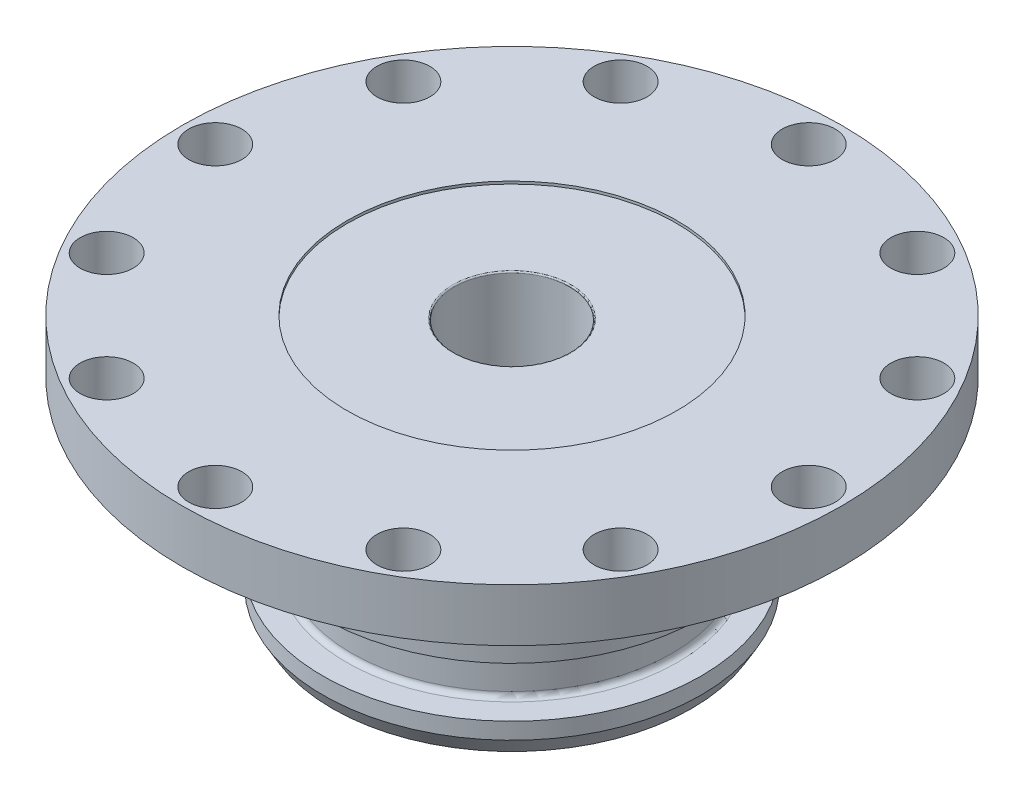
ISO-10303-21;
HEADER;
FILE_DESCRIPTION(('STEP AP214'),'2;1');
FILE_NAME('part.step','',(''),(''),'','','');
FILE_SCHEMA(('AUTOMOTIVE_DESIGN { 1 0 10303 214 1 1 1 1 }'));
ENDSEC;
DATA;
#1=APPLICATION_CONTEXT('core data for automotive mechanical design processes');
#2=APPLICATION_PROTOCOL_DEFINITION('international standard','automotive_design',2000,#1);
#3=PRODUCT_CONTEXT('',#1,'mechanical');
#4=PRODUCT('Part','Part','',(#3));
#5=PRODUCT_RELATED_PRODUCT_CATEGORY('part','',(#4));
#6=PRODUCT_DEFINITION_FORMATION('','',#4);
#7=PRODUCT_DEFINITION_CONTEXT('part definition',#1,'design');
#8=PRODUCT_DEFINITION('design','',#6,#7);
#9=PRODUCT_DEFINITION_SHAPE('','',#8);
#10=(LENGTH_UNIT() NAMED_UNIT(*) SI_UNIT(.MILLI.,.METRE.));
#11=(NAMED_UNIT(*) PLANE_ANGLE_UNIT() SI_UNIT($,.RADIAN.));
#12=(NAMED_UNIT(*) SI_UNIT($,.STERADIAN.) SOLID_ANGLE_UNIT());
#13=UNCERTAINTY_MEASURE_WITH_UNIT(LENGTH_MEASURE(1.E-05),#10,'distance_accuracy_value','');
#14=(GEOMETRIC_REPRESENTATION_CONTEXT(3) GLOBAL_UNCERTAINTY_ASSIGNED_CONTEXT((#13)) GLOBAL_UNIT_ASSIGNED_CONTEXT((#10,
#11,#12)) REPRESENTATION_CONTEXT('',''));
#15=CARTESIAN_POINT('',(0.,0.,0.));
#16=DIRECTION('',(0.,0.,1.));
#17=DIRECTION('',(1.,0.,0.));
#18=AXIS2_PLACEMENT_3D('',#15,#16,#17);
#19=CARTESIAN_POINT('',(31.75,24.13,0.));
#20=DIRECTION('',(0.,-1.,0.));
#21=DIRECTION('',(1.,0.,0.));
#22=AXIS2_PLACEMENT_3D('',#19,#20,#21);
#23=PLANE('',#22);
#24=CARTESIAN_POINT('',(0.,24.13,0.));
#25=DIRECTION('',(0.,1.,0.));
#26=DIRECTION('',(-1.,0.,0.));
#27=AXIS2_PLACEMENT_3D('',#24,#25,#26);
#28=CIRCLE('',#27,15.875);
#29=CARTESIAN_POINT('',(-15.875,24.13,0.));
#30=VERTEX_POINT('',#29);
#31=EDGE_CURVE('E173',#30,#30,#28,.T.);
#32=ORIENTED_EDGE('',*,*,#31,.F.);
#33=EDGE_LOOP('',(#32));
#34=FACE_BOUND('',#33,.T.);
#35=CARTESIAN_POINT('',(0.,24.13,-28.575));
#36=DIRECTION('',(0.,1.,0.));
#37=DIRECTION('',(0.,0.,1.));
#38=AXIS2_PLACEMENT_3D('',#35,#36,#37);
#39=CIRCLE('',#38,2.5527);
#40=CARTESIAN_POINT('',(0.,24.13,-26.0223));
#41=VERTEX_POINT('',#40);
#42=EDGE_CURVE('E81',#41,#41,#39,.T.);
#43=ORIENTED_EDGE('',*,*,#42,.F.);
#44=EDGE_LOOP('',(#43));
#45=FACE_BOUND('',#44,.T.);
#46=CARTESIAN_POINT('',(14.2875,24.13,-24.7466759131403));
#47=DIRECTION('',(0.,1.,0.));
#48=DIRECTION('',(0.,0.,1.));
#49=AXIS2_PLACEMENT_3D('',#46,#47,#48);
#50=CIRCLE('',#49,2.5527);
#51=CARTESIAN_POINT('',(14.2875,24.13,-22.1939759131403));
#52=VERTEX_POINT('',#51);
#53=EDGE_CURVE('E80',#52,#52,#50,.T.);
#54=ORIENTED_EDGE('',*,*,#53,.F.);
#55=EDGE_LOOP('',(#54));
#56=FACE_BOUND('',#55,.T.);
#57=CARTESIAN_POINT('',(24.7466759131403,24.13,-14.2875));
#58=DIRECTION('',(0.,1.,0.));
#59=DIRECTION('',(0.,0.,1.));
#60=AXIS2_PLACEMENT_3D('',#57,#58,#59);
#61=CIRCLE('',#60,2.5527);
#62=CARTESIAN_POINT('',(24.7466759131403,24.13,-11.7348));
#63=VERTEX_POINT('',#62);
#64=EDGE_CURVE('E85',#63,#63,#61,.T.);
#65=ORIENTED_EDGE('',*,*,#64,.F.);
#66=EDGE_LOOP('',(#65));
#67=FACE_BOUND('',#66,.T.);
#68=CARTESIAN_POINT('',(28.575,24.13,0.));
#69=DIRECTION('',(0.,1.,0.));
#70=DIRECTION('',(0.,0.,1.));
#71=AXIS2_PLACEMENT_3D('',#68,#69,#70);
#72=CIRCLE('',#71,2.5527);
#73=CARTESIAN_POINT('',(28.575,24.13,2.5527));
#74=VERTEX_POINT('',#73);
#75=EDGE_CURVE('E89',#74,#74,#72,.T.);
#76=ORIENTED_EDGE('',*,*,#75,.F.);
#77=EDGE_LOOP('',(#76));
#78=FACE_BOUND('',#77,.T.);
#79=CARTESIAN_POINT('',(24.7466759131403,24.13,14.2875));
#80=DIRECTION('',(0.,1.,0.));
#81=DIRECTION('',(0.,0.,1.));
#82=AXIS2_PLACEMENT_3D('',#79,#80,#81);
#83=CIRCLE('',#82,2.5527);
#84=CARTESIAN_POINT('',(24.7466759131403,24.13,16.8402));
#85=VERTEX_POINT('',#84);
#86=EDGE_CURVE('E93',#85,#85,#83,.T.);
#87=ORIENTED_EDGE('',*,*,#86,.F.);
#88=EDGE_LOOP('',(#87));
#89=FACE_BOUND('',#88,.T.);
#90=CARTESIAN_POINT('',(14.2875,24.13,24.7466759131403));
#91=DIRECTION('',(0.,1.,0.));
#92=DIRECTION('',(0.,0.,1.));
#93=AXIS2_PLACEMENT_3D('',#90,#91,#92);
#94=CIRCLE('',#93,2.5527);
#95=CARTESIAN_POINT('',(14.2875,24.13,27.2993759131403));
#96=VERTEX_POINT('',#95);
#97=EDGE_CURVE('E97',#96,#96,#94,.T.);
#98=ORIENTED_EDGE('',*,*,#97,.F.);
#99=EDGE_LOOP('',(#98));
#100=FACE_BOUND('',#99,.T.);
#101=CARTESIAN_POINT('',(0.,24.13,28.575));
#102=DIRECTION('',(0.,1.,0.));
#103=DIRECTION('',(0.,0.,1.));
#104=AXIS2_PLACEMENT_3D('',#101,#102,#103);
#105=CIRCLE('',#104,2.5527);
#106=CARTESIAN_POINT('',(0.,24.13,31.1277));
#107=VERTEX_POINT('',#106);
#108=EDGE_CURVE('E101',#107,#107,#105,.T.);
#109=ORIENTED_EDGE('',*,*,#108,.F.);
#110=EDGE_LOOP('',(#109));
#111=FACE_BOUND('',#110,.T.);
#112=CARTESIAN_POINT('',(-14.2875,24.13,24.7466759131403));
#113=DIRECTION('',(0.,1.,0.));
#114=DIRECTION('',(0.,0.,1.));
#115=AXIS2_PLACEMENT_3D('',#112,#113,#114);
#116=CIRCLE('',#115,2.5527);
#117=CARTESIAN_POINT('',(-14.2875,24.13,27.2993759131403));
#118=VERTEX_POINT('',#117);
#119=EDGE_CURVE('E105',#118,#118,#116,.T.);
#120=ORIENTED_EDGE('',*,*,#119,.F.);
#121=EDGE_LOOP('',(#120));
#122=FACE_BOUND('',#121,.T.);
#123=CARTESIAN_POINT('',(-24.7466759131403,24.13,14.2875));
#124=DIRECTION('',(0.,1.,0.));
#125=DIRECTION('',(0.,0.,1.));
#126=AXIS2_PLACEMENT_3D('',#123,#124,#125);
#127=CIRCLE('',#126,2.5527);
#128=CARTESIAN_POINT('',(-24.7466759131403,24.13,16.8402));
#129=VERTEX_POINT('',#128);
#130=EDGE_CURVE('E109',#129,#129,#127,.T.);
#131=ORIENTED_EDGE('',*,*,#130,.F.);
#132=EDGE_LOOP('',(#131));
#133=FACE_BOUND('',#132,.T.);
#134=CARTESIAN_POINT('',(-28.575,24.13,0.));
#135=DIRECTION('',(0.,1.,0.));
#136=DIRECTION('',(0.,0.,1.));
#137=AXIS2_PLACEMENT_3D('',#134,#135,#136);
#138=CIRCLE('',#137,2.5527);
#139=CARTESIAN_POINT('',(-28.575,24.13,2.5527));
#140=VERTEX_POINT('',#139);
#141=EDGE_CURVE('E113',#140,#140,#138,.T.);
#142=ORIENTED_EDGE('',*,*,#141,.F.);
#143=EDGE_LOOP('',(#142));
#144=FACE_BOUND('',#143,.T.);
#145=CARTESIAN_POINT('',(-24.7466759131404,24.13,-14.2875));
#146=DIRECTION('',(0.,1.,0.));
#147=DIRECTION('',(0.,0.,1.));
#148=AXIS2_PLACEMENT_3D('',#145,#146,#147);
#149=CIRCLE('',#148,2.5527);
#150=CARTESIAN_POINT('',(-24.7466759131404,24.13,-11.7348));
#151=VERTEX_POINT('',#150);
#152=EDGE_CURVE('E117',#151,#151,#149,.T.);
#153=ORIENTED_EDGE('',*,*,#152,.F.);
#154=EDGE_LOOP('',(#153));
#155=FACE_BOUND('',#154,.T.);
#156=CARTESIAN_POINT('',(-14.2875,24.13,-24.7466759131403));
#157=DIRECTION('',(0.,1.,0.));
#158=DIRECTION('',(0.,0.,1.));
#159=AXIS2_PLACEMENT_3D('',#156,#157,#158);
#160=CIRCLE('',#159,2.5527);
#161=CARTESIAN_POINT('',(-14.2875,24.13,-22.1939759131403));
#162=VERTEX_POINT('',#161);
#163=EDGE_CURVE('E121',#162,#162,#160,.T.);
#164=ORIENTED_EDGE('',*,*,#163,.F.);
#165=EDGE_LOOP('',(#164));
#166=FACE_BOUND('',#165,.T.);
#167=CARTESIAN_POINT('',(0.,24.13,0.));
#168=DIRECTION('',(0.,1.,0.));
#169=DIRECTION('',(-1.,0.,0.));
#170=AXIS2_PLACEMENT_3D('',#167,#168,#169);
#171=CIRCLE('',#170,31.75);
#172=CARTESIAN_POINT('',(-31.75,24.13,0.));
#173=VERTEX_POINT('',#172);
#174=EDGE_CURVE('E76',#173,#173,#171,.T.);
#175=ORIENTED_EDGE('',*,*,#174,.T.);
#176=EDGE_LOOP('',(#175));
#177=FACE_BOUND('',#176,.T.);
#178=ADVANCED_FACE('F32',(#34,#45,#56,#67,#78,#89,#100,#111,#122,#133,#144,#155,#166,#177),#23,.F.);
#179=CARTESIAN_POINT('',(0.,0.,0.));
#180=DIRECTION('',(0.,1.,0.));
#181=DIRECTION('',(-1.,0.,0.));
#182=AXIS2_PLACEMENT_3D('',#179,#180,#181);
#183=CYLINDRICAL_SURFACE('',#182,31.75);
#184=ORIENTED_EDGE('',*,*,#174,.F.);
#185=EDGE_LOOP('',(#184));
#186=FACE_BOUND('',#185,.T.);
#187=CARTESIAN_POINT('',(0.,19.05,0.));
#188=DIRECTION('',(0.,1.,0.));
#189=DIRECTION('',(-1.,0.,0.));
#190=AXIS2_PLACEMENT_3D('',#187,#188,#189);
#191=CIRCLE('',#190,31.75);
#192=CARTESIAN_POINT('',(-31.75,19.05,0.));
#193=VERTEX_POINT('',#192);
#194=EDGE_CURVE('E128',#193,#193,#191,.T.);
#195=ORIENTED_EDGE('',*,*,#194,.T.);
#196=EDGE_LOOP('',(#195));
#197=FACE_BOUND('',#196,.T.);
#198=ADVANCED_FACE('F198',(#186,#197),#183,.T.);
#199=CARTESIAN_POINT('',(19.00555,19.05,0.));
#200=DIRECTION('',(0.,1.,0.));
#201=DIRECTION('',(-1.,0.,0.));
#202=AXIS2_PLACEMENT_3D('',#199,#200,#201);
#203=PLANE('',#202);
#204=CARTESIAN_POINT('',(0.,19.05,-28.575));
#205=DIRECTION('',(0.,1.,0.));
#206=DIRECTION('',(-1.,0.,0.));
#207=AXIS2_PLACEMENT_3D('',#204,#205,#206);
#208=CIRCLE('',#207,2.5527);
#209=CARTESIAN_POINT('',(-2.5527,19.05,-28.575));
#210=VERTEX_POINT('',#209);
#211=EDGE_CURVE('E77',#210,#210,#208,.T.);
#212=ORIENTED_EDGE('',*,*,#211,.T.);
#213=EDGE_LOOP('',(#212));
#214=FACE_BOUND('',#213,.T.);
#215=CARTESIAN_POINT('',(14.2875,19.05,-24.7466759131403));
#216=DIRECTION('',(0.,1.,0.));
#217=DIRECTION('',(-1.,0.,0.));
#218=AXIS2_PLACEMENT_3D('',#215,#216,#217);
#219=CIRCLE('',#218,2.5527);
#220=CARTESIAN_POINT('',(11.7348,19.05,-24.7466759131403));
#221=VERTEX_POINT('',#220);
#222=EDGE_CURVE('E82',#221,#221,#219,.T.);
#223=ORIENTED_EDGE('',*,*,#222,.T.);
#224=EDGE_LOOP('',(#223));
#225=FACE_BOUND('',#224,.T.);
#226=CARTESIAN_POINT('',(24.7466759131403,19.05,-14.2875));
#227=DIRECTION('',(0.,1.,0.));
#228=DIRECTION('',(-1.,0.,0.));
#229=AXIS2_PLACEMENT_3D('',#226,#227,#228);
#230=CIRCLE('',#229,2.5527);
#231=CARTESIAN_POINT('',(22.1939759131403,19.05,-14.2875));
#232=VERTEX_POINT('',#231);
#233=EDGE_CURVE('E86',#232,#232,#230,.T.);
#234=ORIENTED_EDGE('',*,*,#233,.T.);
#235=EDGE_LOOP('',(#234));
#236=FACE_BOUND('',#235,.T.);
#237=CARTESIAN_POINT('',(28.575,19.05,0.));
#238=DIRECTION('',(0.,1.,0.));
#239=DIRECTION('',(-1.,0.,0.));
#240=AXIS2_PLACEMENT_3D('',#237,#238,#239);
#241=CIRCLE('',#240,2.5527);
#242=CARTESIAN_POINT('',(26.0223,19.05,0.));
#243=VERTEX_POINT('',#242);
#244=EDGE_CURVE('E90',#243,#243,#241,.T.);
#245=ORIENTED_EDGE('',*,*,#244,.T.);
#246=EDGE_LOOP('',(#245));
#247=FACE_BOUND('',#246,.T.);
#248=CARTESIAN_POINT('',(24.7466759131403,19.05,14.2875));
#249=DIRECTION('',(0.,1.,0.));
#250=DIRECTION('',(-1.,0.,0.));
#251=AXIS2_PLACEMENT_3D('',#248,#249,#250);
#252=CIRCLE('',#251,2.5527);
#253=CARTESIAN_POINT('',(22.1939759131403,19.05,14.2875));
#254=VERTEX_POINT('',#253);
#255=EDGE_CURVE('E94',#254,#254,#252,.T.);
#256=ORIENTED_EDGE('',*,*,#255,.T.);
#257=EDGE_LOOP('',(#256));
#258=FACE_BOUND('',#257,.T.);
#259=CARTESIAN_POINT('',(14.2875,19.05,24.7466759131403));
#260=DIRECTION('',(0.,1.,0.));
#261=DIRECTION('',(-1.,0.,0.));
#262=AXIS2_PLACEMENT_3D('',#259,#260,#261);
#263=CIRCLE('',#262,2.5527);
#264=CARTESIAN_POINT('',(11.7348,19.05,24.7466759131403));
#265=VERTEX_POINT('',#264);
#266=EDGE_CURVE('E98',#265,#265,#263,.T.);
#267=ORIENTED_EDGE('',*,*,#266,.T.);
#268=EDGE_LOOP('',(#267));
#269=FACE_BOUND('',#268,.T.);
#270=CARTESIAN_POINT('',(0.,19.05,28.575));
#271=DIRECTION('',(0.,1.,0.));
#272=DIRECTION('',(-1.,0.,0.));
#273=AXIS2_PLACEMENT_3D('',#270,#271,#272);
#274=CIRCLE('',#273,2.5527);
#275=CARTESIAN_POINT('',(-2.55269999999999,19.05,28.575));
#276=VERTEX_POINT('',#275);
#277=EDGE_CURVE('E102',#276,#276,#274,.T.);
#278=ORIENTED_EDGE('',*,*,#277,.T.);
#279=EDGE_LOOP('',(#278));
#280=FACE_BOUND('',#279,.T.);
#281=CARTESIAN_POINT('',(-14.2875,19.05,24.7466759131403));
#282=DIRECTION('',(0.,1.,0.));
#283=DIRECTION('',(-1.,0.,0.));
#284=AXIS2_PLACEMENT_3D('',#281,#282,#283);
#285=CIRCLE('',#284,2.5527);
#286=CARTESIAN_POINT('',(-16.8402,19.05,24.7466759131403));
#287=VERTEX_POINT('',#286);
#288=EDGE_CURVE('E106',#287,#287,#285,.T.);
#289=ORIENTED_EDGE('',*,*,#288,.T.);
#290=EDGE_LOOP('',(#289));
#291=FACE_BOUND('',#290,.T.);
#292=CARTESIAN_POINT('',(-24.7466759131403,19.05,14.2875));
#293=DIRECTION('',(0.,1.,0.));
#294=DIRECTION('',(-1.,0.,0.));
#295=AXIS2_PLACEMENT_3D('',#292,#293,#294);
#296=CIRCLE('',#295,2.5527);
#297=CARTESIAN_POINT('',(-27.2993759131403,19.05,14.2875));
#298=VERTEX_POINT('',#297);
#299=EDGE_CURVE('E110',#298,#298,#296,.T.);
#300=ORIENTED_EDGE('',*,*,#299,.T.);
#301=EDGE_LOOP('',(#300));
#302=FACE_BOUND('',#301,.T.);
#303=CARTESIAN_POINT('',(-28.575,19.05,0.));
#304=DIRECTION('',(0.,1.,0.));
#305=DIRECTION('',(-1.,0.,0.));
#306=AXIS2_PLACEMENT_3D('',#303,#304,#305);
#307=CIRCLE('',#306,2.5527);
#308=CARTESIAN_POINT('',(-31.1277,19.05,0.));
#309=VERTEX_POINT('',#308);
#310=EDGE_CURVE('E114',#309,#309,#307,.T.);
#311=ORIENTED_EDGE('',*,*,#310,.T.);
#312=EDGE_LOOP('',(#311));
#313=FACE_BOUND('',#312,.T.);
#314=CARTESIAN_POINT('',(-24.7466759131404,19.05,-14.2875));
#315=DIRECTION('',(0.,1.,0.));
#316=DIRECTION('',(-1.,0.,0.));
#317=AXIS2_PLACEMENT_3D('',#314,#315,#316);
#318=CIRCLE('',#317,2.5527);
#319=CARTESIAN_POINT('',(-27.2993759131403,19.05,-14.2875));
#320=VERTEX_POINT('',#319);
#321=EDGE_CURVE('E118',#320,#320,#318,.T.);
#322=ORIENTED_EDGE('',*,*,#321,.T.);
#323=EDGE_LOOP('',(#322));
#324=FACE_BOUND('',#323,.T.);
#325=CARTESIAN_POINT('',(-14.2875,19.05,-24.7466759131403));
#326=DIRECTION('',(0.,1.,0.));
#327=DIRECTION('',(-1.,0.,0.));
#328=AXIS2_PLACEMENT_3D('',#325,#326,#327);
#329=CIRCLE('',#328,2.5527);
#330=CARTESIAN_POINT('',(-16.8402,19.05,-24.7466759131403));
#331=VERTEX_POINT('',#330);
#332=EDGE_CURVE('E122',#331,#331,#329,.T.);
#333=ORIENTED_EDGE('',*,*,#332,.T.);
#334=EDGE_LOOP('',(#333));
#335=FACE_BOUND('',#334,.T.);
#336=ORIENTED_EDGE('',*,*,#194,.F.);
#337=EDGE_LOOP('',(#336));
#338=FACE_BOUND('',#337,.T.);
#339=CARTESIAN_POINT('',(0.,19.05,0.));
#340=DIRECTION('',(0.,1.,0.));
#341=DIRECTION('',(-1.,0.,0.));
#342=AXIS2_PLACEMENT_3D('',#339,#340,#341);
#343=CIRCLE('',#342,19.00555);
#344=CARTESIAN_POINT('',(-19.00555,19.05,0.));
#345=VERTEX_POINT('',#344);
#346=EDGE_CURVE('E131',#345,#345,#343,.T.);
#347=ORIENTED_EDGE('',*,*,#346,.T.);
#348=EDGE_LOOP('',(#347));
#349=FACE_BOUND('',#348,.T.);
#350=ADVANCED_FACE('F204',(#214,#225,#236,#247,#258,#269,#280,#291,#302,#313,#324,#335,#338,
#349),#203,.F.);
#351=CARTESIAN_POINT('',(0.,18.25625,0.));
#352=DIRECTION('',(0.,1.,0.));
#353=DIRECTION('',(-1.,0.,0.));
#354=AXIS2_PLACEMENT_3D('',#351,#352,#353);
#355=TOROIDAL_SURFACE('',#354,19.00555,0.793749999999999);
#356=ORIENTED_EDGE('',*,*,#346,.F.);
#357=EDGE_LOOP('',(#356));
#358=FACE_BOUND('',#357,.T.);
#359=CARTESIAN_POINT('',(0.,18.25625,0.));
#360=DIRECTION('',(0.,1.,0.));
#361=DIRECTION('',(-1.,0.,0.));
#362=AXIS2_PLACEMENT_3D('',#359,#360,#361);
#363=CIRCLE('',#362,18.2118);
#364=CARTESIAN_POINT('',(-18.2118,18.25625,0.));
#365=VERTEX_POINT('',#364);
#366=EDGE_CURVE('E134',#365,#365,#363,.T.);
#367=ORIENTED_EDGE('',*,*,#366,.T.);
#368=EDGE_LOOP('',(#367));
#369=FACE_BOUND('',#368,.T.);
#370=ADVANCED_FACE('F241',(#358,#369),#355,.F.);
#371=CARTESIAN_POINT('',(0.,0.,0.));
#372=DIRECTION('',(0.,1.,0.));
#373=DIRECTION('',(-1.,0.,0.));
#374=AXIS2_PLACEMENT_3D('',#371,#372,#373);
#375=CYLINDRICAL_SURFACE('',#374,18.2118);
#376=ORIENTED_EDGE('',*,*,#366,.F.);
#377=EDGE_LOOP('',(#376));
#378=FACE_BOUND('',#377,.T.);
#379=CARTESIAN_POINT('',(0.,16.002,0.));
#380=DIRECTION('',(0.,1.,0.));
#381=DIRECTION('',(-1.,0.,0.));
#382=AXIS2_PLACEMENT_3D('',#379,#380,#381);
#383=CIRCLE('',#382,18.2118);
#384=CARTESIAN_POINT('',(-18.2118,16.002,0.));
#385=VERTEX_POINT('',#384);
#386=EDGE_CURVE('E137',#385,#385,#383,.T.);
#387=ORIENTED_EDGE('',*,*,#386,.T.);
#388=EDGE_LOOP('',(#387));
#389=FACE_BOUND('',#388,.T.);
#390=ADVANCED_FACE('F236',(#378,#389),#375,.T.);
#391=CARTESIAN_POINT('',(15.4305,16.002,0.));
#392=DIRECTION('',(0.,1.,0.));
#393=DIRECTION('',(-1.,0.,0.));
#394=AXIS2_PLACEMENT_3D('',#391,#392,#393);
#395=PLANE('',#394);
#396=CARTESIAN_POINT('',(0.,16.002,0.));
#397=DIRECTION('',(0.,1.,0.));
#398=DIRECTION('',(-1.,0.,0.));
#399=AXIS2_PLACEMENT_3D('',#396,#397,#398);
#400=CIRCLE('',#399,15.9385);
#401=CARTESIAN_POINT('',(-15.9385,16.002,0.));
#402=VERTEX_POINT('',#401);
#403=EDGE_CURVE('E52',#402,#402,#400,.T.);
#404=ORIENTED_EDGE('',*,*,#403,.T.);
#405=EDGE_LOOP('',(#404));
#406=FACE_BOUND('',#405,.T.);
#407=ORIENTED_EDGE('',*,*,#386,.F.);
#408=EDGE_LOOP('',(#407));
#409=FACE_BOUND('',#408,.T.);
#410=ADVANCED_FACE('F232',(#406,#409),#395,.F.);
#411=CARTESIAN_POINT('',(0.,0.,0.));
#412=DIRECTION('',(0.,1.,0.));
#413=DIRECTION('',(-1.,0.,0.));
#414=AXIS2_PLACEMENT_3D('',#411,#412,#413);
#415=CYLINDRICAL_SURFACE('',#414,15.4305);
#416=CARTESIAN_POINT('',(0.,11.684,0.));
#417=DIRECTION('',(0.,-1.,0.));
#418=DIRECTION('',(1.,0.,0.));
#419=AXIS2_PLACEMENT_3D('',#416,#417,#418);
#420=CIRCLE('',#419,15.4305);
#421=CARTESIAN_POINT('',(15.4305,11.684,0.));
#422=VERTEX_POINT('',#421);
#423=EDGE_CURVE('E58',#422,#422,#420,.F.);
#424=ORIENTED_EDGE('',*,*,#423,.T.);
#425=EDGE_LOOP('',(#424));
#426=FACE_BOUND('',#425,.T.);
#427=CARTESIAN_POINT('',(0.,15.494,0.));
#428=DIRECTION('',(0.,1.,0.));
#429=DIRECTION('',(-1.,0.,0.));
#430=AXIS2_PLACEMENT_3D('',#427,#428,#429);
#431=CIRCLE('',#430,15.4305);
#432=CARTESIAN_POINT('',(-15.4305,15.494,0.));
#433=VERTEX_POINT('',#432);
#434=EDGE_CURVE('E61',#433,#433,#431,.F.);
#435=ORIENTED_EDGE('',*,*,#434,.T.);
#436=EDGE_LOOP('',(#435));
#437=FACE_BOUND('',#436,.T.);
#438=ADVANCED_FACE('F235',(#426,#437),#415,.T.);
#439=CARTESIAN_POINT('',(18.2118,11.176,0.));
#440=DIRECTION('',(0.,-1.,0.));
#441=DIRECTION('',(1.,0.,0.));
#442=AXIS2_PLACEMENT_3D('',#439,#440,#441);
#443=PLANE('',#442);
#444=CARTESIAN_POINT('',(0.,11.176,0.));
#445=DIRECTION('',(0.,-1.,0.));
#446=DIRECTION('',(1.,0.,0.));
#447=AXIS2_PLACEMENT_3D('',#444,#445,#446);
#448=CIRCLE('',#447,15.9385);
#449=CARTESIAN_POINT('',(15.9385,11.176,0.));
#450=VERTEX_POINT('',#449);
#451=EDGE_CURVE('E55',#450,#450,#448,.T.);
#452=ORIENTED_EDGE('',*,*,#451,.T.);
#453=EDGE_LOOP('',(#452));
#454=FACE_BOUND('',#453,.T.);
#455=CARTESIAN_POINT('',(0.,11.176,0.));
#456=DIRECTION('',(0.,1.,0.));
#457=DIRECTION('',(-1.,0.,0.));
#458=AXIS2_PLACEMENT_3D('',#455,#456,#457);
#459=CIRCLE('',#458,18.2118);
#460=CARTESIAN_POINT('',(-18.2118,11.176,0.));
#461=VERTEX_POINT('',#460);
#462=EDGE_CURVE('E140',#461,#461,#459,.T.);
#463=ORIENTED_EDGE('',*,*,#462,.T.);
#464=EDGE_LOOP('',(#463));
#465=FACE_BOUND('',#464,.T.);
#466=ADVANCED_FACE('F319',(#454,#465),#443,.F.);
#467=CARTESIAN_POINT('',(0.,0.,0.));
#468=DIRECTION('',(0.,1.,0.));
#469=DIRECTION('',(-1.,0.,0.));
#470=AXIS2_PLACEMENT_3D('',#467,#468,#469);
#471=CYLINDRICAL_SURFACE('',#470,18.2118);
#472=ORIENTED_EDGE('',*,*,#462,.F.);
#473=EDGE_LOOP('',(#472));
#474=FACE_BOUND('',#473,.T.);
#475=CARTESIAN_POINT('',(0.,8.001,0.));
#476=DIRECTION('',(0.,1.,0.));
#477=DIRECTION('',(-1.,0.,0.));
#478=AXIS2_PLACEMENT_3D('',#475,#476,#477);
#479=CIRCLE('',#478,18.2118);
#480=CARTESIAN_POINT('',(-18.2118,8.001,0.));
#481=VERTEX_POINT('',#480);
#482=EDGE_CURVE('E143',#481,#481,#479,.T.);
#483=ORIENTED_EDGE('',*,*,#482,.T.);
#484=EDGE_LOOP('',(#483));
#485=FACE_BOUND('',#484,.T.);
#486=ADVANCED_FACE('F315',(#474,#485),#471,.T.);
#487=CARTESIAN_POINT('',(15.4305,8.001,0.));
#488=DIRECTION('',(0.,1.,0.));
#489=DIRECTION('',(-1.,0.,0.));
#490=AXIS2_PLACEMENT_3D('',#487,#488,#489);
#491=PLANE('',#490);
#492=CARTESIAN_POINT('',(0.,8.001,0.));
#493=DIRECTION('',(0.,1.,0.));
#494=DIRECTION('',(-1.,0.,0.));
#495=AXIS2_PLACEMENT_3D('',#492,#493,#494);
#496=CIRCLE('',#495,15.9385);
#497=CARTESIAN_POINT('',(-15.9385,8.001,0.));
#498=VERTEX_POINT('',#497);
#499=EDGE_CURVE('E64',#498,#498,#496,.T.);
#500=ORIENTED_EDGE('',*,*,#499,.T.);
#501=EDGE_LOOP('',(#500));
#502=FACE_BOUND('',#501,.T.);
#503=ORIENTED_EDGE('',*,*,#482,.F.);
#504=EDGE_LOOP('',(#503));
#505=FACE_BOUND('',#504,.T.);
#506=ADVANCED_FACE('F311',(#502,#505),#491,.F.);
#507=CARTESIAN_POINT('',(0.,0.,0.));
#508=DIRECTION('',(0.,1.,0.));
#509=DIRECTION('',(-1.,0.,0.));
#510=AXIS2_PLACEMENT_3D('',#507,#508,#509);
#511=CYLINDRICAL_SURFACE('',#510,15.4305);
#512=CARTESIAN_POINT('',(0.,3.683,0.));
#513=DIRECTION('',(0.,-1.,0.));
#514=DIRECTION('',(1.,0.,0.));
#515=AXIS2_PLACEMENT_3D('',#512,#513,#514);
#516=CIRCLE('',#515,15.4305);
#517=CARTESIAN_POINT('',(15.4305,3.683,0.));
#518=VERTEX_POINT('',#517);
#519=EDGE_CURVE('E70',#518,#518,#516,.F.);
#520=ORIENTED_EDGE('',*,*,#519,.T.);
#521=EDGE_LOOP('',(#520));
#522=FACE_BOUND('',#521,.T.);
#523=CARTESIAN_POINT('',(0.,7.493,0.));
#524=DIRECTION('',(0.,1.,0.));
#525=DIRECTION('',(-1.,0.,0.));
#526=AXIS2_PLACEMENT_3D('',#523,#524,#525);
#527=CIRCLE('',#526,15.4305);
#528=CARTESIAN_POINT('',(-15.4305,7.493,0.));
#529=VERTEX_POINT('',#528);
#530=EDGE_CURVE('E73',#529,#529,#527,.F.);
#531=ORIENTED_EDGE('',*,*,#530,.T.);
#532=EDGE_LOOP('',(#531));
#533=FACE_BOUND('',#532,.T.);
#534=ADVANCED_FACE('F307',(#522,#533),#511,.T.);
#535=CARTESIAN_POINT('',(18.2118,3.175,0.));
#536=DIRECTION('',(0.,-1.,0.));
#537=DIRECTION('',(1.,0.,0.));
#538=AXIS2_PLACEMENT_3D('',#535,#536,#537);
#539=PLANE('',#538);
#540=CARTESIAN_POINT('',(0.,3.175,0.));
#541=DIRECTION('',(0.,-1.,0.));
#542=DIRECTION('',(1.,0.,0.));
#543=AXIS2_PLACEMENT_3D('',#540,#541,#542);
#544=CIRCLE('',#543,15.9385);
#545=CARTESIAN_POINT('',(15.9385,3.175,0.));
#546=VERTEX_POINT('',#545);
#547=EDGE_CURVE('E67',#546,#546,#544,.T.);
#548=ORIENTED_EDGE('',*,*,#547,.T.);
#549=EDGE_LOOP('',(#548));
#550=FACE_BOUND('',#549,.T.);
#551=CARTESIAN_POINT('',(0.,3.175,0.));
#552=DIRECTION('',(0.,1.,0.));
#553=DIRECTION('',(-1.,0.,0.));
#554=AXIS2_PLACEMENT_3D('',#551,#552,#553);
#555=CIRCLE('',#554,18.2118);
#556=CARTESIAN_POINT('',(-18.2118,3.175,0.));
#557=VERTEX_POINT('',#556);
#558=EDGE_CURVE('E125',#557,#557,#555,.T.);
#559=ORIENTED_EDGE('',*,*,#558,.T.);
#560=EDGE_LOOP('',(#559));
#561=FACE_BOUND('',#560,.T.);
#562=ADVANCED_FACE('F303',(#550,#561),#539,.F.);
#563=CARTESIAN_POINT('',(0.,0.,0.));
#564=DIRECTION('',(0.,1.,0.));
#565=DIRECTION('',(-1.,0.,0.));
#566=AXIS2_PLACEMENT_3D('',#563,#564,#565);
#567=CYLINDRICAL_SURFACE('',#566,18.2118);
#568=CARTESIAN_POINT('',(0.,1.58750000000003,0.));
#569=DIRECTION('',(0.,1.,0.));
#570=DIRECTION('',(-1.,0.,0.));
#571=AXIS2_PLACEMENT_3D('',#568,#569,#570);
#572=CIRCLE('',#571,18.2118);
#573=CARTESIAN_POINT('',(-18.2118,1.58750000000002,0.));
#574=VERTEX_POINT('',#573);
#575=EDGE_CURVE('E47',#574,#574,#572,.T.);
#576=ORIENTED_EDGE('',*,*,#575,.T.);
#577=EDGE_LOOP('',(#576));
#578=FACE_BOUND('',#577,.T.);
#579=ORIENTED_EDGE('',*,*,#558,.F.);
#580=EDGE_LOOP('',(#579));
#581=FACE_BOUND('',#580,.T.);
#582=ADVANCED_FACE('F297',(#578,#581),#567,.T.);
#583=CARTESIAN_POINT('',(0.,0.,0.));
#584=DIRECTION('',(0.,1.,0.));
#585=DIRECTION('',(-1.,0.,0.));
#586=AXIS2_PLACEMENT_3D('',#583,#584,#585);
#587=PLANE('',#586);
#588=CARTESIAN_POINT('',(0.,0.,0.));
#589=DIRECTION('',(0.,1.,0.));
#590=DIRECTION('',(0.,0.,1.));
#591=AXIS2_PLACEMENT_3D('',#588,#589,#590);
#592=CIRCLE('',#591,5.55624999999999);
#593=CARTESIAN_POINT('',(0.,0.,5.55624999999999));
#594=VERTEX_POINT('',#593);
#595=EDGE_CURVE('E176',#594,#594,#592,.T.);
#596=ORIENTED_EDGE('',*,*,#595,.T.);
#597=EDGE_LOOP('',(#596));
#598=FACE_BOUND('',#597,.T.);
#599=CARTESIAN_POINT('',(0.,0.,0.));
#600=DIRECTION('',(0.,1.,0.));
#601=DIRECTION('',(-1.,0.,0.));
#602=AXIS2_PLACEMENT_3D('',#599,#600,#601);
#603=CIRCLE('',#602,17.2952564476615);
#604=CARTESIAN_POINT('',(-17.2952564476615,0.,0.));
#605=VERTEX_POINT('',#604);
#606=EDGE_CURVE('E43',#605,#605,#603,.F.);
#607=ORIENTED_EDGE('',*,*,#606,.T.);
#608=EDGE_LOOP('',(#607));
#609=FACE_BOUND('',#608,.T.);
#610=ADVANCED_FACE('F182',(#598,#609),#587,.F.);
#611=CARTESIAN_POINT('',(-14.2875,24.13,-24.7466759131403));
#612=DIRECTION('',(0.,1.,0.));
#613=DIRECTION('',(0.,0.,1.));
#614=AXIS2_PLACEMENT_3D('',#611,#612,#613);
#615=CYLINDRICAL_SURFACE('',#614,2.5527);
#616=ORIENTED_EDGE('',*,*,#163,.T.);
#617=EDGE_LOOP('',(#616));
#618=FACE_BOUND('',#617,.T.);
#619=ORIENTED_EDGE('',*,*,#332,.F.);
#620=EDGE_LOOP('',(#619));
#621=FACE_BOUND('',#620,.T.);
#622=ADVANCED_FACE('F285',(#618,#621),#615,.F.);
#623=CARTESIAN_POINT('',(-24.7466759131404,24.13,-14.2875));
#624=DIRECTION('',(0.,1.,0.));
#625=DIRECTION('',(0.,0.,1.));
#626=AXIS2_PLACEMENT_3D('',#623,#624,#625);
#627=CYLINDRICAL_SURFACE('',#626,2.5527);
#628=ORIENTED_EDGE('',*,*,#152,.T.);
#629=EDGE_LOOP('',(#628));
#630=FACE_BOUND('',#629,.T.);
#631=ORIENTED_EDGE('',*,*,#321,.F.);
#632=EDGE_LOOP('',(#631));
#633=FACE_BOUND('',#632,.T.);
#634=ADVANCED_FACE('F287',(#630,#633),#627,.F.);
#635=CARTESIAN_POINT('',(-28.575,24.13,0.));
#636=DIRECTION('',(0.,1.,0.));
#637=DIRECTION('',(0.,0.,1.));
#638=AXIS2_PLACEMENT_3D('',#635,#636,#637);
#639=CYLINDRICAL_SURFACE('',#638,2.5527);
#640=ORIENTED_EDGE('',*,*,#141,.T.);
#641=EDGE_LOOP('',(#640));
#642=FACE_BOUND('',#641,.T.);
#643=ORIENTED_EDGE('',*,*,#310,.F.);
#644=EDGE_LOOP('',(#643));
#645=FACE_BOUND('',#644,.T.);
#646=ADVANCED_FACE('F294',(#642,#645),#639,.F.);
#647=CARTESIAN_POINT('',(-24.7466759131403,24.13,14.2875));
#648=DIRECTION('',(0.,1.,0.));
#649=DIRECTION('',(0.,0.,1.));
#650=AXIS2_PLACEMENT_3D('',#647,#648,#649);
#651=CYLINDRICAL_SURFACE('',#650,2.5527);
#652=ORIENTED_EDGE('',*,*,#130,.T.);
#653=EDGE_LOOP('',(#652));
#654=FACE_BOUND('',#653,.T.);
#655=ORIENTED_EDGE('',*,*,#299,.F.);
#656=EDGE_LOOP('',(#655));
#657=FACE_BOUND('',#656,.T.);
#658=ADVANCED_FACE('F478',(#654,#657),#651,.F.);
#659=CARTESIAN_POINT('',(-14.2875,24.13,24.7466759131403));
#660=DIRECTION('',(0.,1.,0.));
#661=DIRECTION('',(0.,0.,1.));
#662=AXIS2_PLACEMENT_3D('',#659,#660,#661);
#663=CYLINDRICAL_SURFACE('',#662,2.5527);
#664=ORIENTED_EDGE('',*,*,#119,.T.);
#665=EDGE_LOOP('',(#664));
#666=FACE_BOUND('',#665,.T.);
#667=ORIENTED_EDGE('',*,*,#288,.F.);
#668=EDGE_LOOP('',(#667));
#669=FACE_BOUND('',#668,.T.);
#670=ADVANCED_FACE('F470',(#666,#669),#663,.F.);
#671=CARTESIAN_POINT('',(0.,24.13,28.575));
#672=DIRECTION('',(0.,1.,0.));
#673=DIRECTION('',(0.,0.,1.));
#674=AXIS2_PLACEMENT_3D('',#671,#672,#673);
#675=CYLINDRICAL_SURFACE('',#674,2.5527);
#676=ORIENTED_EDGE('',*,*,#108,.T.);
#677=EDGE_LOOP('',(#676));
#678=FACE_BOUND('',#677,.T.);
#679=ORIENTED_EDGE('',*,*,#277,.F.);
#680=EDGE_LOOP('',(#679));
#681=FACE_BOUND('',#680,.T.);
#682=ADVANCED_FACE('F462',(#678,#681),#675,.F.);
#683=CARTESIAN_POINT('',(14.2875,24.13,24.7466759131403));
#684=DIRECTION('',(0.,1.,0.));
#685=DIRECTION('',(0.,0.,1.));
#686=AXIS2_PLACEMENT_3D('',#683,#684,#685);
#687=CYLINDRICAL_SURFACE('',#686,2.5527);
#688=ORIENTED_EDGE('',*,*,#97,.T.);
#689=EDGE_LOOP('',(#688));
#690=FACE_BOUND('',#689,.T.);
#691=ORIENTED_EDGE('',*,*,#266,.F.);
#692=EDGE_LOOP('',(#691));
#693=FACE_BOUND('',#692,.T.);
#694=ADVANCED_FACE('F454',(#690,#693),#687,.F.);
#695=CARTESIAN_POINT('',(24.7466759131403,24.13,14.2875));
#696=DIRECTION('',(0.,1.,0.));
#697=DIRECTION('',(0.,0.,1.));
#698=AXIS2_PLACEMENT_3D('',#695,#696,#697);
#699=CYLINDRICAL_SURFACE('',#698,2.5527);
#700=ORIENTED_EDGE('',*,*,#86,.T.);
#701=EDGE_LOOP('',(#700));
#702=FACE_BOUND('',#701,.T.);
#703=ORIENTED_EDGE('',*,*,#255,.F.);
#704=EDGE_LOOP('',(#703));
#705=FACE_BOUND('',#704,.T.);
#706=ADVANCED_FACE('F446',(#702,#705),#699,.F.);
#707=CARTESIAN_POINT('',(28.575,24.13,0.));
#708=DIRECTION('',(0.,1.,0.));
#709=DIRECTION('',(0.,0.,1.));
#710=AXIS2_PLACEMENT_3D('',#707,#708,#709);
#711=CYLINDRICAL_SURFACE('',#710,2.5527);
#712=ORIENTED_EDGE('',*,*,#75,.T.);
#713=EDGE_LOOP('',(#712));
#714=FACE_BOUND('',#713,.T.);
#715=ORIENTED_EDGE('',*,*,#244,.F.);
#716=EDGE_LOOP('',(#715));
#717=FACE_BOUND('',#716,.T.);
#718=ADVANCED_FACE('F438',(#714,#717),#711,.F.);
#719=CARTESIAN_POINT('',(24.7466759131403,24.13,-14.2875));
#720=DIRECTION('',(0.,1.,0.));
#721=DIRECTION('',(0.,0.,1.));
#722=AXIS2_PLACEMENT_3D('',#719,#720,#721);
#723=CYLINDRICAL_SURFACE('',#722,2.5527);
#724=ORIENTED_EDGE('',*,*,#64,.T.);
#725=EDGE_LOOP('',(#724));
#726=FACE_BOUND('',#725,.T.);
#727=ORIENTED_EDGE('',*,*,#233,.F.);
#728=EDGE_LOOP('',(#727));
#729=FACE_BOUND('',#728,.T.);
#730=ADVANCED_FACE('F430',(#726,#729),#723,.F.);
#731=CARTESIAN_POINT('',(14.2875,24.13,-24.7466759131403));
#732=DIRECTION('',(0.,1.,0.));
#733=DIRECTION('',(0.,0.,1.));
#734=AXIS2_PLACEMENT_3D('',#731,#732,#733);
#735=CYLINDRICAL_SURFACE('',#734,2.5527);
#736=ORIENTED_EDGE('',*,*,#53,.T.);
#737=EDGE_LOOP('',(#736));
#738=FACE_BOUND('',#737,.T.);
#739=ORIENTED_EDGE('',*,*,#222,.F.);
#740=EDGE_LOOP('',(#739));
#741=FACE_BOUND('',#740,.T.);
#742=ADVANCED_FACE('F422',(#738,#741),#735,.F.);
#743=CARTESIAN_POINT('',(0.,24.13,-28.575));
#744=DIRECTION('',(0.,1.,0.));
#745=DIRECTION('',(0.,0.,1.));
#746=AXIS2_PLACEMENT_3D('',#743,#744,#745);
#747=CYLINDRICAL_SURFACE('',#746,2.5527);
#748=ORIENTED_EDGE('',*,*,#42,.T.);
#749=EDGE_LOOP('',(#748));
#750=FACE_BOUND('',#749,.T.);
#751=ORIENTED_EDGE('',*,*,#211,.F.);
#752=EDGE_LOOP('',(#751));
#753=FACE_BOUND('',#752,.T.);
#754=ADVANCED_FACE('F415',(#750,#753),#747,.F.);
#755=CARTESIAN_POINT('',(0.,23.876,0.));
#756=DIRECTION('',(0.,1.,0.));
#757=DIRECTION('',(-1.,0.,0.));
#758=AXIS2_PLACEMENT_3D('',#755,#756,#757);
#759=CYLINDRICAL_SURFACE('',#758,15.875);
#760=CARTESIAN_POINT('',(0.,23.876,0.));
#761=DIRECTION('',(0.,1.,0.));
#762=DIRECTION('',(-1.,0.,0.));
#763=AXIS2_PLACEMENT_3D('',#760,#761,#762);
#764=CIRCLE('',#763,15.875);
#765=CARTESIAN_POINT('',(-15.875,23.876,0.));
#766=VERTEX_POINT('',#765);
#767=EDGE_CURVE('E172',#766,#766,#764,.T.);
#768=ORIENTED_EDGE('',*,*,#767,.F.);
#769=EDGE_LOOP('',(#768));
#770=FACE_BOUND('',#769,.T.);
#771=ORIENTED_EDGE('',*,*,#31,.T.);
#772=EDGE_LOOP('',(#771));
#773=FACE_BOUND('',#772,.T.);
#774=ADVANCED_FACE('F373',(#770,#773),#759,.F.);
#775=CARTESIAN_POINT('',(0.,23.876,0.));
#776=DIRECTION('',(0.,1.,0.));
#777=DIRECTION('',(-1.,0.,0.));
#778=AXIS2_PLACEMENT_3D('',#775,#776,#777);
#779=PLANE('',#778);
#780=CARTESIAN_POINT('',(0.,23.876,0.));
#781=DIRECTION('',(0.,1.,0.));
#782=DIRECTION('',(-1.,0.,0.));
#783=AXIS2_PLACEMENT_3D('',#780,#781,#782);
#784=CIRCLE('',#783,5.68325);
#785=CARTESIAN_POINT('',(-5.68325,23.876,0.));
#786=VERTEX_POINT('',#785);
#787=EDGE_CURVE('E10',#786,#786,#784,.F.);
#788=ORIENTED_EDGE('',*,*,#787,.T.);
#789=EDGE_LOOP('',(#788));
#790=FACE_BOUND('',#789,.T.);
#791=ORIENTED_EDGE('',*,*,#767,.T.);
#792=EDGE_LOOP('',(#791));
#793=FACE_BOUND('',#792,.T.);
#794=ADVANCED_FACE('F215',(#790,#793),#779,.T.);
#795=CARTESIAN_POINT('',(0.,3.683,0.));
#796=DIRECTION('',(0.,-1.,0.));
#797=DIRECTION('',(1.,0.,0.));
#798=AXIS2_PLACEMENT_3D('',#795,#796,#797);
#799=TOROIDAL_SURFACE('',#798,15.9385,0.508);
#800=ORIENTED_EDGE('',*,*,#547,.F.);
#801=EDGE_LOOP('',(#800));
#802=FACE_BOUND('',#801,.T.);
#803=ORIENTED_EDGE('',*,*,#519,.F.);
#804=EDGE_LOOP('',(#803));
#805=FACE_BOUND('',#804,.T.);
#806=ADVANCED_FACE('F211',(#802,#805),#799,.F.);
#807=CARTESIAN_POINT('',(0.,7.493,0.));
#808=DIRECTION('',(0.,1.,0.));
#809=DIRECTION('',(-1.,0.,0.));
#810=AXIS2_PLACEMENT_3D('',#807,#808,#809);
#811=TOROIDAL_SURFACE('',#810,15.9385,0.508);
#812=ORIENTED_EDGE('',*,*,#530,.F.);
#813=EDGE_LOOP('',(#812));
#814=FACE_BOUND('',#813,.T.);
#815=ORIENTED_EDGE('',*,*,#499,.F.);
#816=EDGE_LOOP('',(#815));
#817=FACE_BOUND('',#816,.T.);
#818=ADVANCED_FACE('F214',(#814,#817),#811,.F.);
#819=CARTESIAN_POINT('',(0.,11.684,0.));
#820=DIRECTION('',(0.,-1.,0.));
#821=DIRECTION('',(1.,0.,0.));
#822=AXIS2_PLACEMENT_3D('',#819,#820,#821);
#823=TOROIDAL_SURFACE('',#822,15.9385,0.508);
#824=ORIENTED_EDGE('',*,*,#451,.F.);
#825=EDGE_LOOP('',(#824));
#826=FACE_BOUND('',#825,.T.);
#827=ORIENTED_EDGE('',*,*,#423,.F.);
#828=EDGE_LOOP('',(#827));
#829=FACE_BOUND('',#828,.T.);
#830=ADVANCED_FACE('F219',(#826,#829),#823,.F.);
#831=CARTESIAN_POINT('',(0.,15.494,0.));
#832=DIRECTION('',(0.,1.,0.));
#833=DIRECTION('',(-1.,0.,0.));
#834=AXIS2_PLACEMENT_3D('',#831,#832,#833);
#835=TOROIDAL_SURFACE('',#834,15.9385,0.508);
#836=ORIENTED_EDGE('',*,*,#434,.F.);
#837=EDGE_LOOP('',(#836));
#838=FACE_BOUND('',#837,.T.);
#839=ORIENTED_EDGE('',*,*,#403,.F.);
#840=EDGE_LOOP('',(#839));
#841=FACE_BOUND('',#840,.T.);
#842=ADVANCED_FACE('F194',(#838,#841),#835,.F.);
#843=CARTESIAN_POINT('',(0.,1.58750000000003,0.));
#844=DIRECTION('',(0.,1.,0.));
#845=DIRECTION('',(-1.,0.,0.));
#846=AXIS2_PLACEMENT_3D('',#843,#844,#845);
#847=CONICAL_SURFACE('',#846,18.2118,0.523598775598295);
#848=ORIENTED_EDGE('',*,*,#606,.F.);
#849=EDGE_LOOP('',(#848));
#850=FACE_BOUND('',#849,.T.);
#851=ORIENTED_EDGE('',*,*,#575,.F.);
#852=EDGE_LOOP('',(#851));
#853=FACE_BOUND('',#852,.T.);
#854=ADVANCED_FACE('F187',(#850,#853),#847,.T.);
#855=CARTESIAN_POINT('',(0.,24.13,0.));
#856=DIRECTION('',(0.,1.,0.));
#857=DIRECTION('',(0.,0.,1.));
#858=AXIS2_PLACEMENT_3D('',#855,#856,#857);
#859=CYLINDRICAL_SURFACE('',#858,5.55625);
#860=CARTESIAN_POINT('',(0.,23.749,0.));
#861=DIRECTION('',(0.,1.,0.));
#862=DIRECTION('',(-1.,0.,0.));
#863=AXIS2_PLACEMENT_3D('',#860,#861,#862);
#864=CIRCLE('',#863,5.55625);
#865=CARTESIAN_POINT('',(-5.55625,23.749,0.));
#866=VERTEX_POINT('',#865);
#867=EDGE_CURVE('E39',#866,#866,#864,.T.);
#868=ORIENTED_EDGE('',*,*,#867,.T.);
#869=EDGE_LOOP('',(#868));
#870=FACE_BOUND('',#869,.T.);
#871=ORIENTED_EDGE('',*,*,#595,.F.);
#872=EDGE_LOOP('',(#871));
#873=FACE_BOUND('',#872,.T.);
#874=ADVANCED_FACE('F185',(#870,#873),#859,.F.);
#875=CARTESIAN_POINT('',(0.,23.749,0.));
#876=DIRECTION('',(0.,1.,0.));
#877=DIRECTION('',(-1.,0.,0.));
#878=AXIS2_PLACEMENT_3D('',#875,#876,#877);
#879=TOROIDAL_SURFACE('',#878,5.68325,0.127);
#880=ORIENTED_EDGE('',*,*,#787,.F.);
#881=EDGE_LOOP('',(#880));
#882=FACE_BOUND('',#881,.T.);
#883=ORIENTED_EDGE('',*,*,#867,.F.);
#884=EDGE_LOOP('',(#883));
#885=FACE_BOUND('',#884,.T.);
#886=ADVANCED_FACE('F34',(#882,#885),#879,.T.);
#887=CLOSED_SHELL('',(#178,#198,#350,#370,#390,#410,#438,#466,#486,#506,#534,#562,#582,#610,
#622,#634,#646,#658,#670,#682,#694,#706,#718,#730,#742,#754,#774,#794,#806,#818,#830,#842,#854,
#874,#886));
#888=MANIFOLD_SOLID_BREP('B2',#887);
#889=ADVANCED_BREP_SHAPE_REPRESENTATION('',(#18,#888),#14);
#890=SHAPE_DEFINITION_REPRESENTATION(#9,#889);
ENDSEC;
END-ISO-10303-21;
